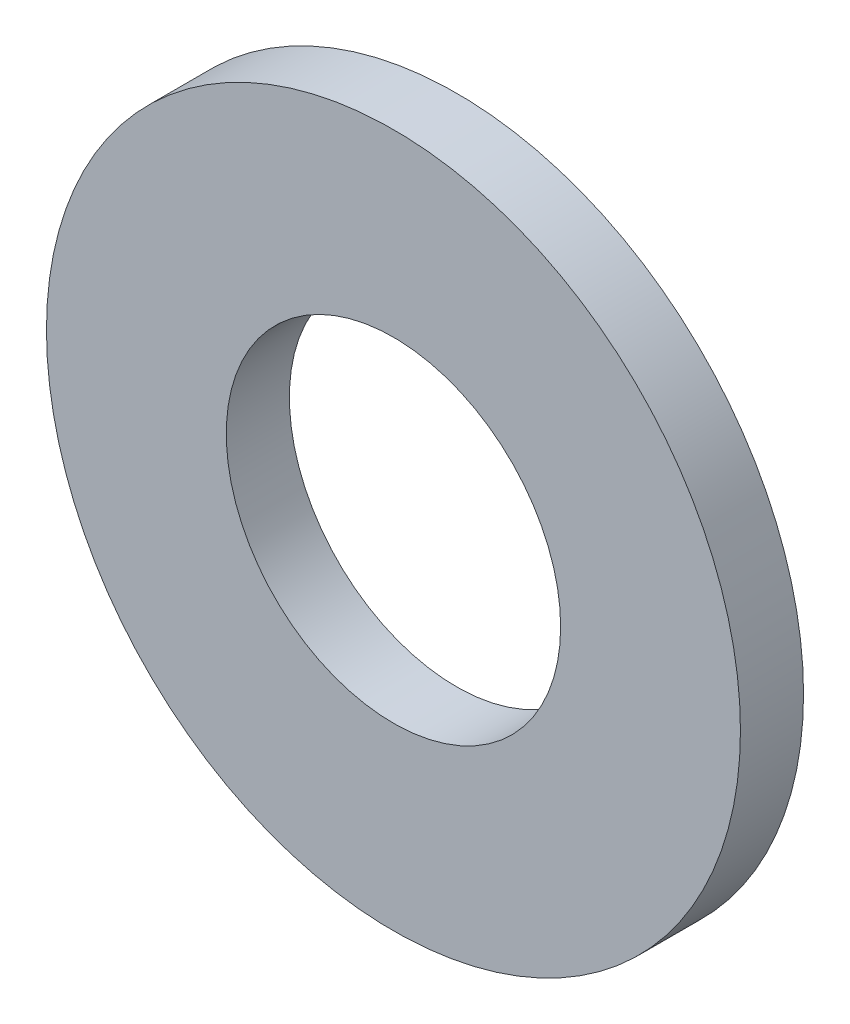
ISO-10303-21;
HEADER;
FILE_DESCRIPTION(('STEP AP214'),'2;1');
FILE_NAME('part.step','',(''),(''),'','','');
FILE_SCHEMA(('AUTOMOTIVE_DESIGN { 1 0 10303 214 1 1 1 1 }'));
ENDSEC;
DATA;
#1=APPLICATION_CONTEXT('core data for automotive mechanical design processes');
#2=APPLICATION_PROTOCOL_DEFINITION('international standard','automotive_design',2000,#1);
#3=PRODUCT_CONTEXT('',#1,'mechanical');
#4=PRODUCT('Part','Part','',(#3));
#5=PRODUCT_RELATED_PRODUCT_CATEGORY('part','',(#4));
#6=PRODUCT_DEFINITION_FORMATION('','',#4);
#7=PRODUCT_DEFINITION_CONTEXT('part definition',#1,'design');
#8=PRODUCT_DEFINITION('design','',#6,#7);
#9=PRODUCT_DEFINITION_SHAPE('','',#8);
#10=(LENGTH_UNIT() NAMED_UNIT(*) SI_UNIT(.MILLI.,.METRE.));
#11=(NAMED_UNIT(*) PLANE_ANGLE_UNIT() SI_UNIT($,.RADIAN.));
#12=(NAMED_UNIT(*) SI_UNIT($,.STERADIAN.) SOLID_ANGLE_UNIT());
#13=UNCERTAINTY_MEASURE_WITH_UNIT(LENGTH_MEASURE(1.E-05),#10,'distance_accuracy_value','');
#14=(GEOMETRIC_REPRESENTATION_CONTEXT(3) GLOBAL_UNCERTAINTY_ASSIGNED_CONTEXT((#13)) GLOBAL_UNIT_ASSIGNED_CONTEXT((#10,
#11,#12)) REPRESENTATION_CONTEXT('',''));
#15=CARTESIAN_POINT('',(0.,0.,0.));
#16=DIRECTION('',(0.,0.,1.));
#17=DIRECTION('',(1.,0.,0.));
#18=AXIS2_PLACEMENT_3D('',#15,#16,#17);
#19=CARTESIAN_POINT('',(0.,0.,-1.));
#20=DIRECTION('',(0.,0.,1.));
#21=DIRECTION('',(1.,0.,0.));
#22=AXIS2_PLACEMENT_3D('',#19,#20,#21);
#23=CYLINDRICAL_SURFACE('',#22,5.5);
#24=CARTESIAN_POINT('',(0.,0.,-1.));
#25=DIRECTION('',(0.,0.,1.));
#26=DIRECTION('',(1.,0.,0.));
#27=AXIS2_PLACEMENT_3D('',#24,#25,#26);
#28=CIRCLE('',#27,5.5);
#29=CARTESIAN_POINT('',(5.5,0.,-1.));
#30=VERTEX_POINT('',#29);
#31=EDGE_CURVE('E10',#30,#30,#28,.T.);
#32=ORIENTED_EDGE('',*,*,#31,.T.);
#33=EDGE_LOOP('',(#32));
#34=FACE_BOUND('',#33,.T.);
#35=CARTESIAN_POINT('',(0.,0.,0.));
#36=DIRECTION('',(0.,0.,1.));
#37=DIRECTION('',(1.,0.,0.));
#38=AXIS2_PLACEMENT_3D('',#35,#36,#37);
#39=CIRCLE('',#38,5.5);
#40=CARTESIAN_POINT('',(5.5,0.,0.));
#41=VERTEX_POINT('',#40);
#42=EDGE_CURVE('E38',#41,#41,#39,.T.);
#43=ORIENTED_EDGE('',*,*,#42,.F.);
#44=EDGE_LOOP('',(#43));
#45=FACE_BOUND('',#44,.T.);
#46=ADVANCED_FACE('F35',(#34,#45),#23,.T.);
#47=CARTESIAN_POINT('',(0.,0.,-1.));
#48=DIRECTION('',(0.,0.,1.));
#49=DIRECTION('',(1.,0.,0.));
#50=AXIS2_PLACEMENT_3D('',#47,#48,#49);
#51=PLANE('',#50);
#52=CARTESIAN_POINT('',(0.,0.,-1.));
#53=DIRECTION('',(0.,0.,1.));
#54=DIRECTION('',(1.,0.,0.));
#55=AXIS2_PLACEMENT_3D('',#52,#53,#54);
#56=CIRCLE('',#55,2.65);
#57=CARTESIAN_POINT('',(2.65,0.,-1.));
#58=VERTEX_POINT('',#57);
#59=EDGE_CURVE('E45',#58,#58,#56,.T.);
#60=ORIENTED_EDGE('',*,*,#59,.T.);
#61=EDGE_LOOP('',(#60));
#62=FACE_BOUND('',#61,.T.);
#63=ORIENTED_EDGE('',*,*,#31,.F.);
#64=EDGE_LOOP('',(#63));
#65=FACE_BOUND('',#64,.T.);
#66=ADVANCED_FACE('F53',(#62,#65),#51,.F.);
#67=CARTESIAN_POINT('',(0.,0.,0.));
#68=DIRECTION('',(0.,0.,1.));
#69=DIRECTION('',(1.,0.,0.));
#70=AXIS2_PLACEMENT_3D('',#67,#68,#69);
#71=PLANE('',#70);
#72=CARTESIAN_POINT('',(0.,0.,0.));
#73=DIRECTION('',(0.,0.,1.));
#74=DIRECTION('',(1.,0.,0.));
#75=AXIS2_PLACEMENT_3D('',#72,#73,#74);
#76=CIRCLE('',#75,2.65);
#77=CARTESIAN_POINT('',(2.65,0.,0.));
#78=VERTEX_POINT('',#77);
#79=EDGE_CURVE('E47',#78,#78,#76,.T.);
#80=ORIENTED_EDGE('',*,*,#79,.F.);
#81=EDGE_LOOP('',(#80));
#82=FACE_BOUND('',#81,.T.);
#83=ORIENTED_EDGE('',*,*,#42,.T.);
#84=EDGE_LOOP('',(#83));
#85=FACE_BOUND('',#84,.T.);
#86=ADVANCED_FACE('F59',(#82,#85),#71,.T.);
#87=CARTESIAN_POINT('',(0.,0.,-1.));
#88=DIRECTION('',(0.,0.,1.));
#89=DIRECTION('',(1.,0.,0.));
#90=AXIS2_PLACEMENT_3D('',#87,#88,#89);
#91=CYLINDRICAL_SURFACE('',#90,2.65);
#92=ORIENTED_EDGE('',*,*,#59,.F.);
#93=EDGE_LOOP('',(#92));
#94=FACE_BOUND('',#93,.T.);
#95=ORIENTED_EDGE('',*,*,#79,.T.);
#96=EDGE_LOOP('',(#95));
#97=FACE_BOUND('',#96,.T.);
#98=ADVANCED_FACE('F56',(#94,#97),#91,.F.);
#99=CLOSED_SHELL('',(#46,#66,#86,#98));
#100=MANIFOLD_SOLID_BREP('B2',#99);
#101=ADVANCED_BREP_SHAPE_REPRESENTATION('',(#18,#100),#14);
#102=SHAPE_DEFINITION_REPRESENTATION(#9,#101);
ENDSEC;
END-ISO-10303-21;
